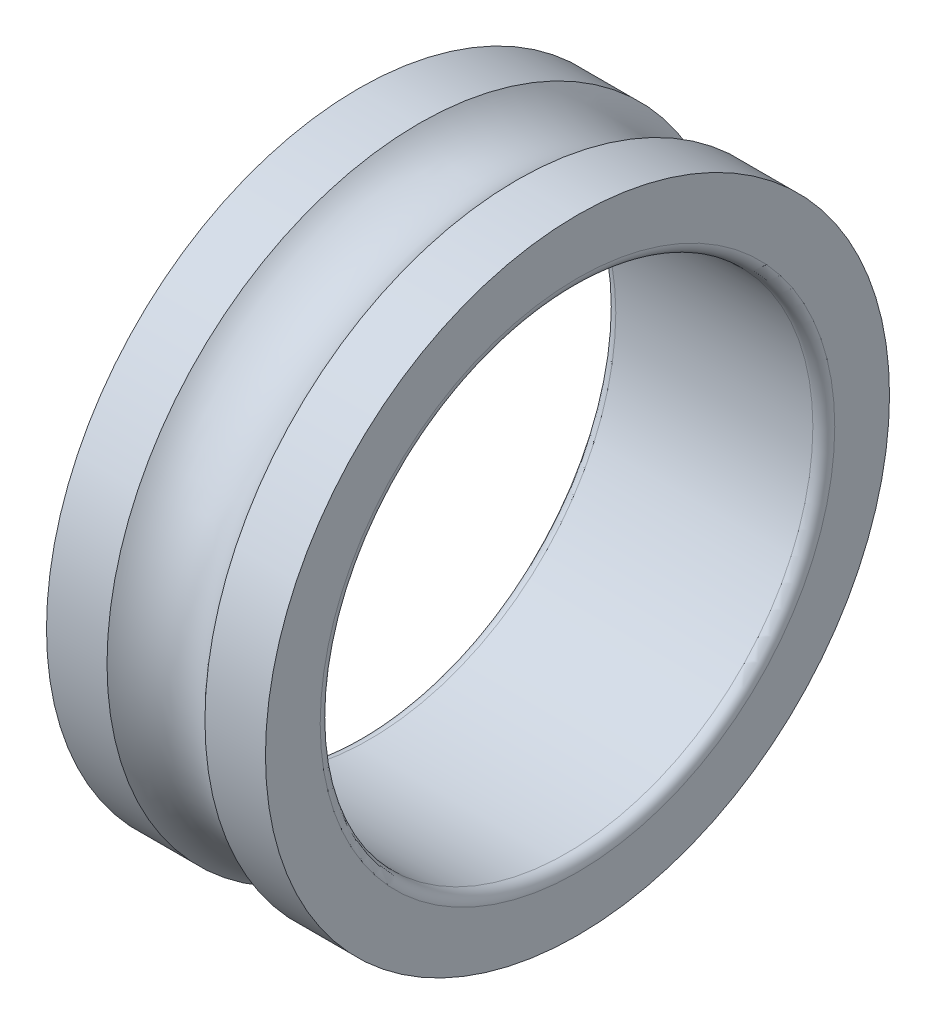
ISO-10303-21;
HEADER;
FILE_DESCRIPTION(('STEP AP214'),'2;1');
FILE_NAME('part.step','',(''),(''),'','','');
FILE_SCHEMA(('AUTOMOTIVE_DESIGN { 1 0 10303 214 1 1 1 1 }'));
ENDSEC;
DATA;
#1=APPLICATION_CONTEXT('core data for automotive mechanical design processes');
#2=APPLICATION_PROTOCOL_DEFINITION('international standard','automotive_design',2000,#1);
#3=PRODUCT_CONTEXT('',#1,'mechanical');
#4=PRODUCT('Part','Part','',(#3));
#5=PRODUCT_RELATED_PRODUCT_CATEGORY('part','',(#4));
#6=PRODUCT_DEFINITION_FORMATION('','',#4);
#7=PRODUCT_DEFINITION_CONTEXT('part definition',#1,'design');
#8=PRODUCT_DEFINITION('design','',#6,#7);
#9=PRODUCT_DEFINITION_SHAPE('','',#8);
#10=(LENGTH_UNIT() NAMED_UNIT(*) SI_UNIT(.MILLI.,.METRE.));
#11=(NAMED_UNIT(*) PLANE_ANGLE_UNIT() SI_UNIT($,.RADIAN.));
#12=(NAMED_UNIT(*) SI_UNIT($,.STERADIAN.) SOLID_ANGLE_UNIT());
#13=UNCERTAINTY_MEASURE_WITH_UNIT(LENGTH_MEASURE(1.E-05),#10,'distance_accuracy_value','');
#14=(GEOMETRIC_REPRESENTATION_CONTEXT(3) GLOBAL_UNCERTAINTY_ASSIGNED_CONTEXT((#13)) GLOBAL_UNIT_ASSIGNED_CONTEXT((#10,
#11,#12)) REPRESENTATION_CONTEXT('',''));
#15=CARTESIAN_POINT('',(0.,0.,0.));
#16=DIRECTION('',(0.,0.,1.));
#17=DIRECTION('',(1.,0.,0.));
#18=AXIS2_PLACEMENT_3D('',#15,#16,#17);
#19=CARTESIAN_POINT('',(0.200000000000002,0.,0.));
#20=DIRECTION('',(-1.,0.,0.));
#21=DIRECTION('',(0.,0.,1.));
#22=AXIS2_PLACEMENT_3D('',#19,#20,#21);
#23=TOROIDAL_SURFACE('',#22,4.7,0.200000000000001);
#24=CARTESIAN_POINT('',(0.200000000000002,0.,0.));
#25=DIRECTION('',(-1.,0.,0.));
#26=DIRECTION('',(0.,0.,1.));
#27=AXIS2_PLACEMENT_3D('',#24,#25,#26);
#28=CIRCLE('',#27,4.5);
#29=CARTESIAN_POINT('',(0.200000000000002,0.,4.5));
#30=VERTEX_POINT('',#29);
#31=EDGE_CURVE('E10',#30,#30,#28,.T.);
#32=ORIENTED_EDGE('',*,*,#31,.F.);
#33=EDGE_LOOP('',(#32));
#34=FACE_BOUND('',#33,.T.);
#35=CARTESIAN_POINT('',(0.,0.,0.));
#36=DIRECTION('',(-1.,0.,0.));
#37=DIRECTION('',(0.,0.,1.));
#38=AXIS2_PLACEMENT_3D('',#35,#36,#37);
#39=CIRCLE('',#38,4.7);
#40=CARTESIAN_POINT('',(0.,0.,4.7));
#41=VERTEX_POINT('',#40);
#42=EDGE_CURVE('E378',#41,#41,#39,.T.);
#43=ORIENTED_EDGE('',*,*,#42,.T.);
#44=EDGE_LOOP('',(#43));
#45=FACE_BOUND('',#44,.T.);
#46=ADVANCED_FACE('F350',(#34,#45),#23,.T.);
#47=CARTESIAN_POINT('',(0.,0.,0.));
#48=DIRECTION('',(-1.,0.,0.));
#49=DIRECTION('',(0.,0.,1.));
#50=AXIS2_PLACEMENT_3D('',#47,#48,#49);
#51=CYLINDRICAL_SURFACE('',#50,4.5);
#52=CARTESIAN_POINT('',(3.8,0.,0.));
#53=DIRECTION('',(-1.,0.,0.));
#54=DIRECTION('',(0.,0.,1.));
#55=AXIS2_PLACEMENT_3D('',#52,#53,#54);
#56=CIRCLE('',#55,4.5);
#57=CARTESIAN_POINT('',(3.8,0.,4.5));
#58=VERTEX_POINT('',#57);
#59=EDGE_CURVE('E356',#58,#58,#56,.T.);
#60=ORIENTED_EDGE('',*,*,#59,.F.);
#61=EDGE_LOOP('',(#60));
#62=FACE_BOUND('',#61,.T.);
#63=ORIENTED_EDGE('',*,*,#31,.T.);
#64=EDGE_LOOP('',(#63));
#65=FACE_BOUND('',#64,.T.);
#66=ADVANCED_FACE('F415',(#62,#65),#51,.F.);
#67=CARTESIAN_POINT('',(3.8,0.,0.));
#68=DIRECTION('',(-1.,0.,0.));
#69=DIRECTION('',(0.,0.,1.));
#70=AXIS2_PLACEMENT_3D('',#67,#68,#69);
#71=TOROIDAL_SURFACE('',#70,4.7,0.200000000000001);
#72=CARTESIAN_POINT('',(4.,0.,0.));
#73=DIRECTION('',(-1.,0.,0.));
#74=DIRECTION('',(0.,0.,1.));
#75=AXIS2_PLACEMENT_3D('',#72,#73,#74);
#76=CIRCLE('',#75,4.7);
#77=CARTESIAN_POINT('',(4.,0.,4.7));
#78=VERTEX_POINT('',#77);
#79=EDGE_CURVE('E360',#78,#78,#76,.T.);
#80=ORIENTED_EDGE('',*,*,#79,.F.);
#81=EDGE_LOOP('',(#80));
#82=FACE_BOUND('',#81,.T.);
#83=ORIENTED_EDGE('',*,*,#59,.T.);
#84=EDGE_LOOP('',(#83));
#85=FACE_BOUND('',#84,.T.);
#86=ADVANCED_FACE('F410',(#82,#85),#71,.T.);
#87=CARTESIAN_POINT('',(4.,0.,-5.7));
#88=DIRECTION('',(-1.,0.,0.));
#89=DIRECTION('',(0.,0.,1.));
#90=AXIS2_PLACEMENT_3D('',#87,#88,#89);
#91=PLANE('',#90);
#92=CARTESIAN_POINT('',(4.,0.,0.));
#93=DIRECTION('',(-1.,0.,0.));
#94=DIRECTION('',(0.,0.,1.));
#95=AXIS2_PLACEMENT_3D('',#92,#93,#94);
#96=CIRCLE('',#95,5.7);
#97=CARTESIAN_POINT('',(4.,0.,5.7));
#98=VERTEX_POINT('',#97);
#99=EDGE_CURVE('E364',#98,#98,#96,.T.);
#100=ORIENTED_EDGE('',*,*,#99,.F.);
#101=EDGE_LOOP('',(#100));
#102=FACE_BOUND('',#101,.T.);
#103=ORIENTED_EDGE('',*,*,#79,.T.);
#104=EDGE_LOOP('',(#103));
#105=FACE_BOUND('',#104,.T.);
#106=ADVANCED_FACE('F404',(#102,#105),#91,.F.);
#107=CARTESIAN_POINT('',(0.,0.,0.));
#108=DIRECTION('',(-1.,0.,0.));
#109=DIRECTION('',(0.,0.,1.));
#110=AXIS2_PLACEMENT_3D('',#107,#108,#109);
#111=CYLINDRICAL_SURFACE('',#110,5.7);
#112=CARTESIAN_POINT('',(2.89442719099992,0.,0.));
#113=DIRECTION('',(-1.,0.,0.));
#114=DIRECTION('',(0.,0.,1.));
#115=AXIS2_PLACEMENT_3D('',#112,#113,#114);
#116=CIRCLE('',#115,5.7);
#117=CARTESIAN_POINT('',(2.89442719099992,0.,5.7));
#118=VERTEX_POINT('',#117);
#119=EDGE_CURVE('E369',#118,#118,#116,.T.);
#120=ORIENTED_EDGE('',*,*,#119,.F.);
#121=EDGE_LOOP('',(#120));
#122=FACE_BOUND('',#121,.T.);
#123=ORIENTED_EDGE('',*,*,#99,.T.);
#124=EDGE_LOOP('',(#123));
#125=FACE_BOUND('',#124,.T.);
#126=ADVANCED_FACE('F398',(#122,#125),#111,.T.);
#127=CARTESIAN_POINT('',(2.,0.,0.));
#128=DIRECTION('',(-1.,0.,0.));
#129=DIRECTION('',(0.,0.,1.));
#130=AXIS2_PLACEMENT_3D('',#127,#128,#129);
#131=TOROIDAL_SURFACE('',#130,6.5,1.2);
#132=CARTESIAN_POINT('',(1.10557280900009,0.,0.));
#133=DIRECTION('',(-1.,0.,0.));
#134=DIRECTION('',(0.,0.,1.));
#135=AXIS2_PLACEMENT_3D('',#132,#133,#134);
#136=CIRCLE('',#135,5.7);
#137=CARTESIAN_POINT('',(1.10557280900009,0.,5.7));
#138=VERTEX_POINT('',#137);
#139=EDGE_CURVE('E372',#138,#138,#136,.T.);
#140=ORIENTED_EDGE('',*,*,#139,.F.);
#141=EDGE_LOOP('',(#140));
#142=FACE_BOUND('',#141,.T.);
#143=ORIENTED_EDGE('',*,*,#119,.T.);
#144=EDGE_LOOP('',(#143));
#145=FACE_BOUND('',#144,.T.);
#146=ADVANCED_FACE('F392',(#142,#145),#131,.F.);
#147=CARTESIAN_POINT('',(0.,0.,0.));
#148=DIRECTION('',(-1.,0.,0.));
#149=DIRECTION('',(0.,0.,1.));
#150=AXIS2_PLACEMENT_3D('',#147,#148,#149);
#151=CYLINDRICAL_SURFACE('',#150,5.7);
#152=CARTESIAN_POINT('',(0.,0.,0.));
#153=DIRECTION('',(-1.,0.,0.));
#154=DIRECTION('',(0.,0.,1.));
#155=AXIS2_PLACEMENT_3D('',#152,#153,#154);
#156=CIRCLE('',#155,5.7);
#157=CARTESIAN_POINT('',(0.,0.,5.7));
#158=VERTEX_POINT('',#157);
#159=EDGE_CURVE('E375',#158,#158,#156,.T.);
#160=ORIENTED_EDGE('',*,*,#159,.F.);
#161=EDGE_LOOP('',(#160));
#162=FACE_BOUND('',#161,.T.);
#163=ORIENTED_EDGE('',*,*,#139,.T.);
#164=EDGE_LOOP('',(#163));
#165=FACE_BOUND('',#164,.T.);
#166=ADVANCED_FACE('F386',(#162,#165),#151,.T.);
#167=CARTESIAN_POINT('',(0.,0.,-5.7));
#168=DIRECTION('',(1.,0.,0.));
#169=DIRECTION('',(0.,0.,-1.));
#170=AXIS2_PLACEMENT_3D('',#167,#168,#169);
#171=PLANE('',#170);
#172=ORIENTED_EDGE('',*,*,#42,.F.);
#173=EDGE_LOOP('',(#172));
#174=FACE_BOUND('',#173,.T.);
#175=ORIENTED_EDGE('',*,*,#159,.T.);
#176=EDGE_LOOP('',(#175));
#177=FACE_BOUND('',#176,.T.);
#178=ADVANCED_FACE('F383',(#174,#177),#171,.F.);
#179=CLOSED_SHELL('',(#46,#66,#86,#106,#126,#146,#166,#178));
#180=MANIFOLD_SOLID_BREP('B2',#179);
#181=ADVANCED_BREP_SHAPE_REPRESENTATION('',(#18,#180),#14);
#182=SHAPE_DEFINITION_REPRESENTATION(#9,#181);
ENDSEC;
END-ISO-10303-21;
